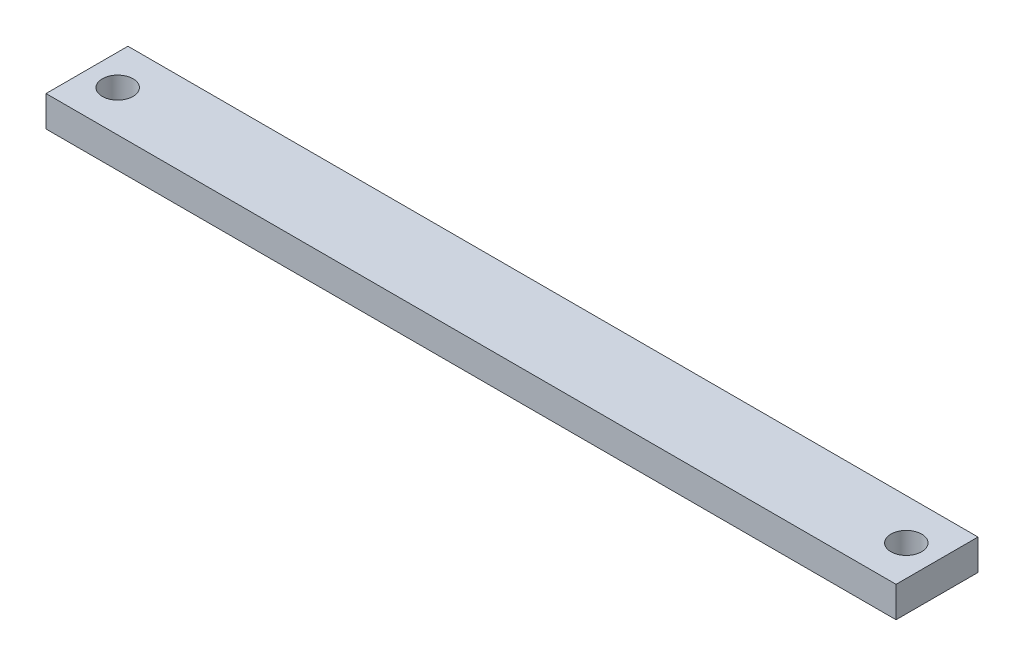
from build123d import *

# Parameters (mm, degrees)
ESQUISSE1_W      = 83
ESQUISSE1_H      = 8
ESQUISSE1_R      = 1.5
EXTRUSION1_DEPTH = 3


with BuildPart() as part:
    # Esquisse1 → Extrusion1 (new body)
    with BuildSketch(Plane(origin=(0, 0, 0), x_dir=(1, 0, 0), z_dir=(0, 1, 0))):
        with Locations((-6.570148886, 4)):
            Rectangle(ESQUISSE1_W, ESQUISSE1_H)
        with Locations(Location((-45.070148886, 4, 0), (0, 0, 270))):
            Circle(ESQUISSE1_R, mode=Mode.SUBTRACT)
        with Locations(Location((31.929851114, 4, 0), (0, 0, 270))):
            Circle(ESQUISSE1_R, mode=Mode.SUBTRACT)
    extrude(amount=EXTRUSION1_DEPTH)


solid = part.part
